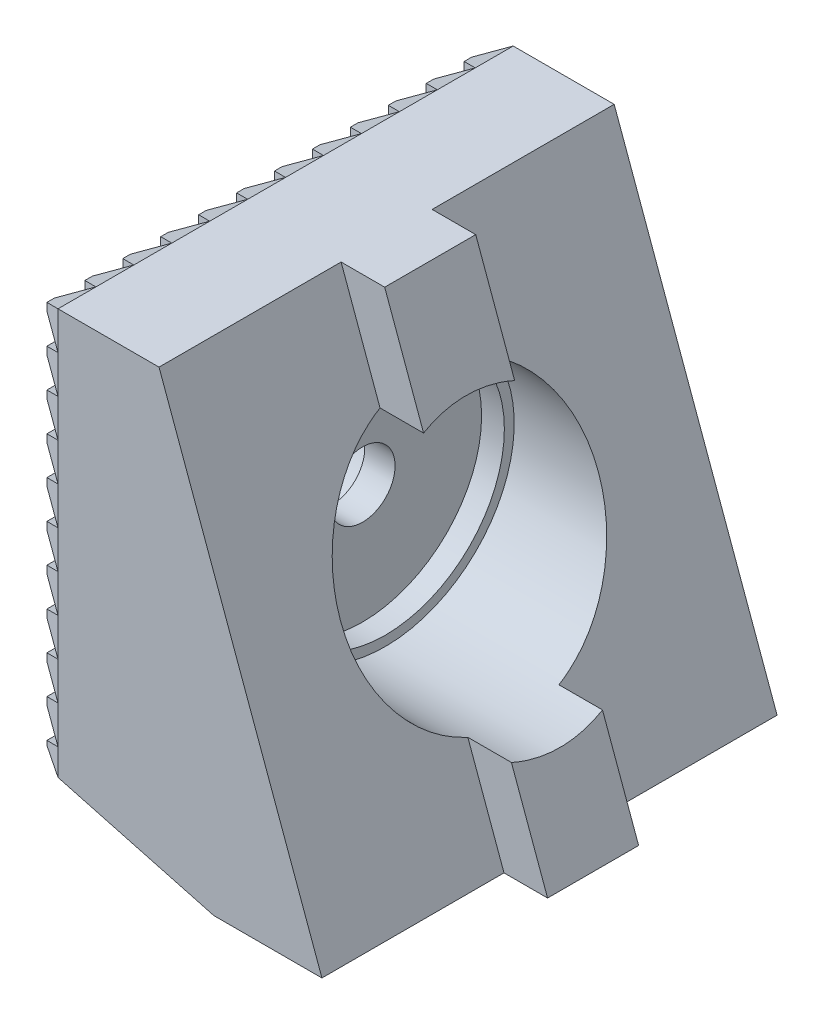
from build123d import *

# Parameters (mm, degrees)
EXTRUDE1_DEPTH      = 30
EXTRUDE2_DEPTH      = 3
EXTRUDE2_DEPTH_BACK = 3
CUT_EXTRUDE1_DEPTH  = 29.5


with BuildPart() as part:
    # Sketch1 → Extrude1 (new body)
    with BuildSketch(Plane.XY):
        Polygon((-22, 28), (-20.267949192, 27), (-22, 26), (-22, 25.5), (-20.267949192, 24.5), (-22, 23.5), (-22, 23), (-20.267949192, 22), (-22, 21), (-22, 20.5), (-20.267949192, 19.5), (-22, 18.5), (-22, 18), (-20.267949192, 17), (-22, 16), (-22, 15.5), (-20.267949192, 14.5), (-22, 13.5), (-22, 13), (-20.267949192, 12), (-22, 11), (-22, 10.5), (-20.267949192, 9.5), (-22, 8.5), (-22, 8), (-20.267949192, 7), (-22, 6), (-22, 5.5), (-20.267949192, 4.5), (-22, 3.5), (-22, 3.215390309), (-10, 0), (-2.873279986, 0), (-13.610401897, 29.5), (-20.267949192, 29.5), (-22, 28.5), align=None)
    extrude(amount=EXTRUDE1_DEPTH)

    # Sketch2 → Extrude2 (add, two sides: drawn at the far end of the back side and taken through both)
    with BuildSketch(Plane.XY.offset(15).offset(-EXTRUDE2_DEPTH_BACK)):
        Polygon((-13.610401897, 29.5), (-2.873279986, 0), (0, 0), (-10.737121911, 29.5), align=None)
    extrude(amount=EXTRUDE2_DEPTH + EXTRUDE2_DEPTH_BACK)

    # Sketch3 → Cut-Revolve1 (revolve, cut)
    with BuildSketch(Plane.XY.offset(15), mode=Mode.PRIVATE) as cut_revolve1_sk:
        Polygon((-22, 14.5), (-22, 18.5), (-17.2, 18.5), (-17.2, 16.65), (-15.2, 16.65), (-15.2, 22.35), (-13.7, 22.35), (-13.7, 23), (0, 23), (0, 14.5), align=None)
    revolve(cut_revolve1_sk.sketch.rotate(Axis((0, 14.5, 15), (-1, 0, 0)), 270), axis=Axis((0, 14.5, 15), (-1, 0, 0)), mode=Mode.SUBTRACT)

    # Sketch4 → Cut-Extrude1 (cut)
    with BuildSketch(Plane(origin=(0, 0, 0), x_dir=(-1, 0, 0), z_dir=(0, 1, 0))):
        Polygon((50, -2), (50, 31.5), (17.669872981, 31.5), (22, 29), (22, 28.5), (20.267949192, 27.5), (22, 26.5), (22, 26), (20.267949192, 25), (22, 24), (22, 23.5), (20.267949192, 22.5), (22, 21.5), (22, 21), (20.267949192, 20), (22, 19), (22, 18.5), (20.267949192, 17.5), (22, 16.5), (22, 16), (20.267949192, 15), (22, 14), (22, 13.5), (20.267949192, 12.5), (22, 11.5), (22, 11), (20.267949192, 10), (22, 9), (22, 8.5), (20.267949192, 7.5), (22, 6.5), (22, 6), (20.267949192, 5), (22, 4), (22, 3.5), (20.267949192, 2.5), (22, 1.5), (22, 1), (16.803847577, -2), align=None)
    extrude(amount=CUT_EXTRUDE1_DEPTH, mode=Mode.SUBTRACT)


solid = part.part
